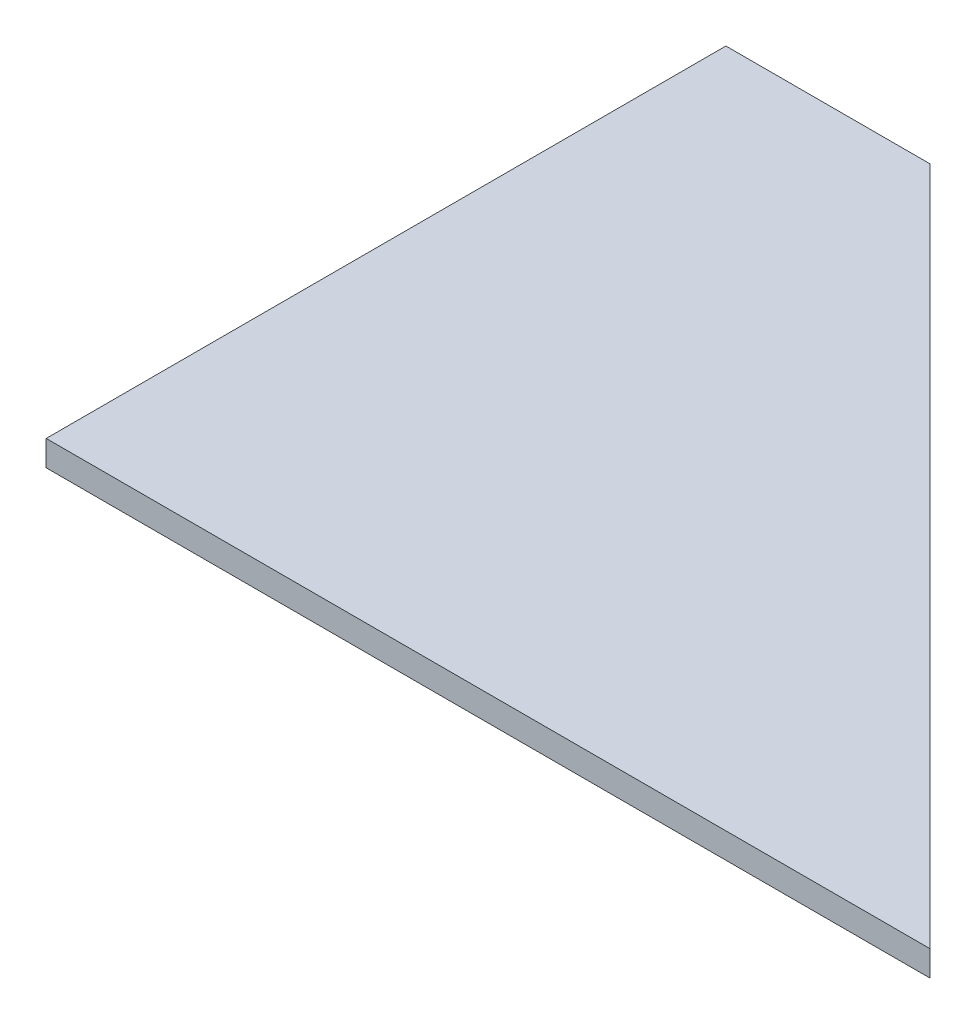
from build123d import *

# Parameters (mm, degrees)
BOSS_EXTRUDE1_DEPTH = 9.525


with BuildPart() as part:
    # Sketch1 → Boss-Extrude1 (new body)
    with BuildSketch(Plane(origin=(0, 0, 0), x_dir=(1, 0, 0), z_dir=(0, 1, 0))):
        Polygon((0, 0), (-254, 254), (-330.2, 254), (-330.2, 0), align=None)
    extrude(amount=BOSS_EXTRUDE1_DEPTH)


solid = part.part
